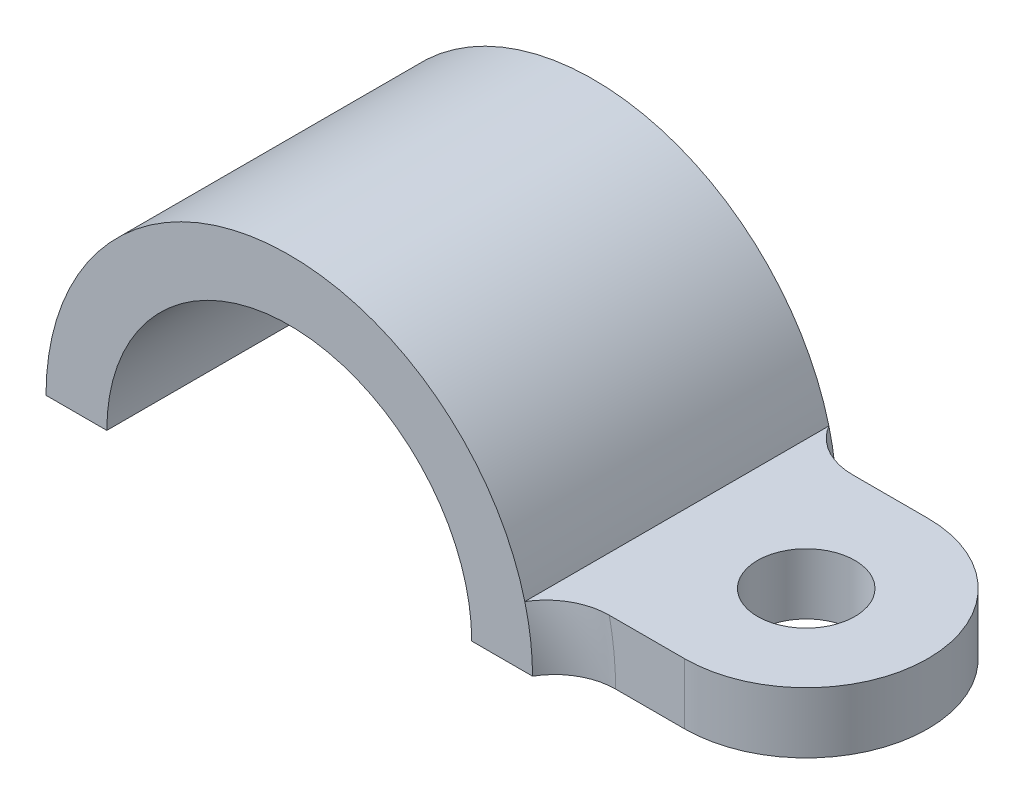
ISO-10303-21;
HEADER;
FILE_DESCRIPTION(('STEP AP214'),'2;1');
FILE_NAME('part.step','',(''),(''),'','','');
FILE_SCHEMA(('AUTOMOTIVE_DESIGN { 1 0 10303 214 1 1 1 1 }'));
ENDSEC;
DATA;
#1=APPLICATION_CONTEXT('core data for automotive mechanical design processes');
#2=APPLICATION_PROTOCOL_DEFINITION('international standard','automotive_design',2000,#1);
#3=PRODUCT_CONTEXT('',#1,'mechanical');
#4=PRODUCT('Part','Part','',(#3));
#5=PRODUCT_RELATED_PRODUCT_CATEGORY('part','',(#4));
#6=PRODUCT_DEFINITION_FORMATION('','',#4);
#7=PRODUCT_DEFINITION_CONTEXT('part definition',#1,'design');
#8=PRODUCT_DEFINITION('design','',#6,#7);
#9=PRODUCT_DEFINITION_SHAPE('','',#8);
#10=(LENGTH_UNIT() NAMED_UNIT(*) SI_UNIT(.MILLI.,.METRE.));
#11=(NAMED_UNIT(*) PLANE_ANGLE_UNIT() SI_UNIT($,.RADIAN.));
#12=(NAMED_UNIT(*) SI_UNIT($,.STERADIAN.) SOLID_ANGLE_UNIT());
#13=UNCERTAINTY_MEASURE_WITH_UNIT(LENGTH_MEASURE(1.E-05),#10,'distance_accuracy_value','');
#14=(GEOMETRIC_REPRESENTATION_CONTEXT(3) GLOBAL_UNCERTAINTY_ASSIGNED_CONTEXT((#13)) GLOBAL_UNIT_ASSIGNED_CONTEXT((#10,
#11,#12)) REPRESENTATION_CONTEXT('',''));
#15=CARTESIAN_POINT('',(0.,0.,0.));
#16=DIRECTION('',(0.,0.,1.));
#17=DIRECTION('',(1.,0.,0.));
#18=AXIS2_PLACEMENT_3D('',#15,#16,#17);
#19=CARTESIAN_POINT('',(60.,0.,0.));
#20=DIRECTION('',(0.,1.,0.));
#21=DIRECTION('',(0.,0.,1.));
#22=AXIS2_PLACEMENT_3D('',#19,#20,#21);
#23=CYLINDRICAL_SURFACE('',#22,20.);
#24=DIRECTION('',(0.,-1.,0.));
#25=VECTOR('',#24,1.);
#26=CARTESIAN_POINT('',(60.,0.,20.));
#27=LINE('',#26,#25);
#28=CARTESIAN_POINT('',(60.,0.,20.));
#29=VERTEX_POINT('',#28);
#30=CARTESIAN_POINT('',(60.,10.,20.));
#31=VERTEX_POINT('',#30);
#32=EDGE_CURVE('E153',#29,#31,#27,.F.);
#33=ORIENTED_EDGE('',*,*,#32,.F.);
#34=CARTESIAN_POINT('',(60.,0.,0.));
#35=DIRECTION('',(0.,1.,0.));
#36=DIRECTION('',(0.,0.,1.));
#37=AXIS2_PLACEMENT_3D('',#34,#35,#36);
#38=CIRCLE('',#37,20.);
#39=CARTESIAN_POINT('',(60.,0.,-20.));
#40=VERTEX_POINT('',#39);
#41=EDGE_CURVE('E170',#40,#29,#38,.F.);
#42=ORIENTED_EDGE('',*,*,#41,.F.);
#43=DIRECTION('',(0.,1.,0.));
#44=VECTOR('',#43,1.);
#45=CARTESIAN_POINT('',(60.,0.,-20.));
#46=LINE('',#45,#44);
#47=CARTESIAN_POINT('',(60.,10.,-20.));
#48=VERTEX_POINT('',#47);
#49=EDGE_CURVE('E159',#48,#40,#46,.F.);
#50=ORIENTED_EDGE('',*,*,#49,.F.);
#51=CARTESIAN_POINT('',(60.,10.,0.));
#52=DIRECTION('',(0.,-1.,0.));
#53=DIRECTION('',(1.,0.,0.));
#54=AXIS2_PLACEMENT_3D('',#51,#52,#53);
#55=CIRCLE('',#54,20.);
#56=EDGE_CURVE('E171',#31,#48,#55,.F.);
#57=ORIENTED_EDGE('',*,*,#56,.F.);
#58=EDGE_LOOP('',(#33,#42,#50,#57));
#59=FACE_BOUND('',#58,.T.);
#60=ADVANCED_FACE('F47',(#59),#23,.T.);
#61=CARTESIAN_POINT('',(0.,0.,25.));
#62=DIRECTION('',(0.,0.,-1.));
#63=DIRECTION('',(-1.,0.,0.));
#64=AXIS2_PLACEMENT_3D('',#61,#62,#63);
#65=CYLINDRICAL_SURFACE('',#64,40.);
#66=DIRECTION('',(0.,0.,-1.));
#67=VECTOR('',#66,1.);
#68=CARTESIAN_POINT('',(38.7298334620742,10.,20.));
#69=LINE('',#68,#67);
#70=CARTESIAN_POINT('',(38.7298334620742,10.,25.));
#71=VERTEX_POINT('',#70);
#72=CARTESIAN_POINT('',(38.7298334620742,10.,-25.));
#73=VERTEX_POINT('',#72);
#74=EDGE_CURVE('E300',#71,#73,#69,.T.);
#75=ORIENTED_EDGE('',*,*,#74,.T.);
#76=CARTESIAN_POINT('',(0.,0.,-25.));
#77=DIRECTION('',(0.,0.,1.));
#78=DIRECTION('',(1.,0.,0.));
#79=AXIS2_PLACEMENT_3D('',#76,#77,#78);
#80=CIRCLE('',#79,40.);
#81=CARTESIAN_POINT('',(-40.,0.,-25.));
#82=VERTEX_POINT('',#81);
#83=EDGE_CURVE('E148',#73,#82,#80,.T.);
#84=ORIENTED_EDGE('',*,*,#83,.T.);
#85=DIRECTION('',(0.,0.,-1.));
#86=VECTOR('',#85,1.);
#87=CARTESIAN_POINT('',(-40.,0.,25.));
#88=LINE('',#87,#86);
#89=CARTESIAN_POINT('',(-40.,0.,25.));
#90=VERTEX_POINT('',#89);
#91=EDGE_CURVE('E142',#90,#82,#88,.T.);
#92=ORIENTED_EDGE('',*,*,#91,.F.);
#93=CARTESIAN_POINT('',(0.,0.,25.));
#94=DIRECTION('',(0.,0.,1.));
#95=DIRECTION('',(1.,0.,0.));
#96=AXIS2_PLACEMENT_3D('',#93,#94,#95);
#97=CIRCLE('',#96,40.);
#98=EDGE_CURVE('E127',#71,#90,#97,.T.);
#99=ORIENTED_EDGE('',*,*,#98,.F.);
#100=EDGE_LOOP('',(#75,#84,#92,#99));
#101=FACE_BOUND('',#100,.T.);
#102=ADVANCED_FACE('F149',(#101),#65,.T.);
#103=CARTESIAN_POINT('',(-40.,0.,25.));
#104=DIRECTION('',(0.,1.,0.));
#105=DIRECTION('',(0.,0.,1.));
#106=AXIS2_PLACEMENT_3D('',#103,#104,#105);
#107=PLANE('',#106);
#108=DIRECTION('',(1.,0.,0.));
#109=VECTOR('',#108,1.);
#110=CARTESIAN_POINT('',(-40.,0.,-25.));
#111=LINE('',#110,#109);
#112=CARTESIAN_POINT('',(-30.,0.,-25.));
#113=VERTEX_POINT('',#112);
#114=EDGE_CURVE('E314',#82,#113,#111,.T.);
#115=ORIENTED_EDGE('',*,*,#114,.T.);
#116=DIRECTION('',(0.,0.,-1.));
#117=VECTOR('',#116,1.);
#118=CARTESIAN_POINT('',(-30.,0.,25.));
#119=LINE('',#118,#117);
#120=CARTESIAN_POINT('',(-30.,0.,25.));
#121=VERTEX_POINT('',#120);
#122=EDGE_CURVE('E141',#121,#113,#119,.T.);
#123=ORIENTED_EDGE('',*,*,#122,.F.);
#124=DIRECTION('',(1.,0.,0.));
#125=VECTOR('',#124,1.);
#126=CARTESIAN_POINT('',(-40.,0.,25.));
#127=LINE('',#126,#125);
#128=EDGE_CURVE('E126',#90,#121,#127,.T.);
#129=ORIENTED_EDGE('',*,*,#128,.F.);
#130=ORIENTED_EDGE('',*,*,#91,.T.);
#131=EDGE_LOOP('',(#115,#123,#129,#130));
#132=FACE_BOUND('',#131,.T.);
#133=ADVANCED_FACE('F140',(#132),#107,.F.);
#134=CARTESIAN_POINT('',(0.,0.,25.));
#135=DIRECTION('',(0.,0.,-1.));
#136=DIRECTION('',(-1.,0.,0.));
#137=AXIS2_PLACEMENT_3D('',#134,#135,#136);
#138=CYLINDRICAL_SURFACE('',#137,30.);
#139=CARTESIAN_POINT('',(0.,0.,-25.));
#140=DIRECTION('',(0.,0.,-1.));
#141=DIRECTION('',(1.,0.,0.));
#142=AXIS2_PLACEMENT_3D('',#139,#140,#141);
#143=CIRCLE('',#142,30.);
#144=CARTESIAN_POINT('',(30.,0.,-25.));
#145=VERTEX_POINT('',#144);
#146=EDGE_CURVE('E319',#113,#145,#143,.T.);
#147=ORIENTED_EDGE('',*,*,#146,.T.);
#148=DIRECTION('',(0.,0.,-1.));
#149=VECTOR('',#148,1.);
#150=CARTESIAN_POINT('',(30.,0.,25.));
#151=LINE('',#150,#149);
#152=CARTESIAN_POINT('',(30.,0.,25.));
#153=VERTEX_POINT('',#152);
#154=EDGE_CURVE('E160',#153,#145,#151,.T.);
#155=ORIENTED_EDGE('',*,*,#154,.F.);
#156=CARTESIAN_POINT('',(0.,0.,25.));
#157=DIRECTION('',(0.,0.,-1.));
#158=DIRECTION('',(1.,0.,0.));
#159=AXIS2_PLACEMENT_3D('',#156,#157,#158);
#160=CIRCLE('',#159,30.);
#161=EDGE_CURVE('E147',#121,#153,#160,.T.);
#162=ORIENTED_EDGE('',*,*,#161,.F.);
#163=ORIENTED_EDGE('',*,*,#122,.T.);
#164=EDGE_LOOP('',(#147,#155,#162,#163));
#165=FACE_BOUND('',#164,.T.);
#166=ADVANCED_FACE('F208',(#165),#138,.F.);
#167=CARTESIAN_POINT('',(30.,0.,25.));
#168=DIRECTION('',(0.,1.,0.));
#169=DIRECTION('',(0.,0.,1.));
#170=AXIS2_PLACEMENT_3D('',#167,#168,#169);
#171=PLANE('',#170);
#172=CARTESIAN_POINT('',(60.,0.,0.));
#173=DIRECTION('',(0.,1.,0.));
#174=DIRECTION('',(-1.,0.,0.));
#175=AXIS2_PLACEMENT_3D('',#172,#173,#174);
#176=CIRCLE('',#175,8.00000000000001);
#177=CARTESIAN_POINT('',(52.,0.,0.));
#178=VERTEX_POINT('',#177);
#179=EDGE_CURVE('E278',#178,#178,#176,.T.);
#180=ORIENTED_EDGE('',*,*,#179,.T.);
#181=EDGE_LOOP('',(#180));
#182=FACE_BOUND('',#181,.T.);
#183=DIRECTION('',(1.,0.,0.));
#184=VECTOR('',#183,1.);
#185=CARTESIAN_POINT('',(30.,0.,-25.));
#186=LINE('',#185,#184);
#187=CARTESIAN_POINT('',(40.,0.,-25.));
#188=VERTEX_POINT('',#187);
#189=EDGE_CURVE('E136',#145,#188,#186,.T.);
#190=ORIENTED_EDGE('',*,*,#189,.T.);
#191=CARTESIAN_POINT('',(48.6602540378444,0.,-30.));
#192=DIRECTION('',(0.,1.,0.));
#193=DIRECTION('',(0.,0.,1.));
#194=AXIS2_PLACEMENT_3D('',#191,#192,#193);
#195=CIRCLE('',#194,10.);
#196=CARTESIAN_POINT('',(48.6602540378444,0.,-20.));
#197=VERTEX_POINT('',#196);
#198=EDGE_CURVE('E179',#188,#197,#195,.T.);
#199=ORIENTED_EDGE('',*,*,#198,.T.);
#200=DIRECTION('',(1.,0.,0.));
#201=VECTOR('',#200,1.);
#202=CARTESIAN_POINT('',(40.,0.,-20.));
#203=LINE('',#202,#201);
#204=EDGE_CURVE('E287',#197,#40,#203,.T.);
#205=ORIENTED_EDGE('',*,*,#204,.T.);
#206=ORIENTED_EDGE('',*,*,#41,.T.);
#207=DIRECTION('',(1.,0.,0.));
#208=VECTOR('',#207,1.);
#209=CARTESIAN_POINT('',(40.,0.,20.));
#210=LINE('',#209,#208);
#211=CARTESIAN_POINT('',(48.6602540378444,0.,20.));
#212=VERTEX_POINT('',#211);
#213=EDGE_CURVE('E290',#212,#29,#210,.T.);
#214=ORIENTED_EDGE('',*,*,#213,.F.);
#215=CARTESIAN_POINT('',(48.6602540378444,0.,30.));
#216=DIRECTION('',(0.,1.,0.));
#217=DIRECTION('',(0.,0.,1.));
#218=AXIS2_PLACEMENT_3D('',#215,#216,#217);
#219=CIRCLE('',#218,10.);
#220=CARTESIAN_POINT('',(40.,0.,25.));
#221=VERTEX_POINT('',#220);
#222=EDGE_CURVE('E61',#212,#221,#219,.T.);
#223=ORIENTED_EDGE('',*,*,#222,.T.);
#224=DIRECTION('',(1.,0.,0.));
#225=VECTOR('',#224,1.);
#226=CARTESIAN_POINT('',(30.,0.,25.));
#227=LINE('',#226,#225);
#228=EDGE_CURVE('E308',#153,#221,#227,.T.);
#229=ORIENTED_EDGE('',*,*,#228,.F.);
#230=ORIENTED_EDGE('',*,*,#154,.T.);
#231=EDGE_LOOP('',(#190,#199,#205,#206,#214,#223,#229,#230));
#232=FACE_BOUND('',#231,.T.);
#233=ADVANCED_FACE('F214',(#182,#232),#171,.F.);
#234=CARTESIAN_POINT('',(0.,0.,25.));
#235=DIRECTION('',(0.,0.,1.));
#236=DIRECTION('',(1.,0.,0.));
#237=AXIS2_PLACEMENT_3D('',#234,#235,#236);
#238=PLANE('',#237);
#239=EDGE_CURVE('E135',#221,#71,#97,.T.);
#240=ORIENTED_EDGE('',*,*,#239,.T.);
#241=ORIENTED_EDGE('',*,*,#98,.T.);
#242=ORIENTED_EDGE('',*,*,#128,.T.);
#243=ORIENTED_EDGE('',*,*,#161,.T.);
#244=ORIENTED_EDGE('',*,*,#228,.T.);
#245=EDGE_LOOP('',(#240,#241,#242,#243,#244));
#246=FACE_BOUND('',#245,.T.);
#247=ADVANCED_FACE('F129',(#246),#238,.T.);
#248=CARTESIAN_POINT('',(0.,0.,-25.));
#249=DIRECTION('',(0.,0.,1.));
#250=DIRECTION('',(1.,0.,0.));
#251=AXIS2_PLACEMENT_3D('',#248,#249,#250);
#252=PLANE('',#251);
#253=EDGE_CURVE('E311',#188,#73,#80,.T.);
#254=ORIENTED_EDGE('',*,*,#253,.F.);
#255=ORIENTED_EDGE('',*,*,#189,.F.);
#256=ORIENTED_EDGE('',*,*,#146,.F.);
#257=ORIENTED_EDGE('',*,*,#114,.F.);
#258=ORIENTED_EDGE('',*,*,#83,.F.);
#259=EDGE_LOOP('',(#254,#255,#256,#257,#258));
#260=FACE_BOUND('',#259,.T.);
#261=ADVANCED_FACE('F218',(#260),#252,.F.);
#262=CARTESIAN_POINT('',(80.,10.,20.));
#263=DIRECTION('',(0.,-1.,0.));
#264=DIRECTION('',(1.,0.,0.));
#265=AXIS2_PLACEMENT_3D('',#262,#263,#264);
#266=PLANE('',#265);
#267=CARTESIAN_POINT('',(60.,10.,0.));
#268=DIRECTION('',(0.,1.,0.));
#269=DIRECTION('',(-1.,0.,0.));
#270=AXIS2_PLACEMENT_3D('',#267,#268,#269);
#271=CIRCLE('',#270,8.00000000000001);
#272=CARTESIAN_POINT('',(52.,10.,0.));
#273=VERTEX_POINT('',#272);
#274=EDGE_CURVE('E283',#273,#273,#271,.T.);
#275=ORIENTED_EDGE('',*,*,#274,.F.);
#276=EDGE_LOOP('',(#275));
#277=FACE_BOUND('',#276,.T.);
#278=DIRECTION('',(-1.,0.,0.));
#279=VECTOR('',#278,1.);
#280=CARTESIAN_POINT('',(80.,10.,20.));
#281=LINE('',#280,#279);
#282=CARTESIAN_POINT('',(47.6216371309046,10.,20.));
#283=VERTEX_POINT('',#282);
#284=EDGE_CURVE('E291',#31,#283,#281,.T.);
#285=ORIENTED_EDGE('',*,*,#284,.F.);
#286=ORIENTED_EDGE('',*,*,#56,.T.);
#287=DIRECTION('',(-1.,0.,0.));
#288=VECTOR('',#287,1.);
#289=CARTESIAN_POINT('',(80.,10.,-20.));
#290=LINE('',#289,#288);
#291=CARTESIAN_POINT('',(47.6216371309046,10.,-20.));
#292=VERTEX_POINT('',#291);
#293=EDGE_CURVE('E295',#48,#292,#290,.T.);
#294=ORIENTED_EDGE('',*,*,#293,.T.);
#295=CARTESIAN_POINT('',(47.6216371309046,10.,-20.));
#296=CARTESIAN_POINT('',(47.3275635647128,10.,-19.9999725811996));
#297=CARTESIAN_POINT('',(47.0334977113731,10.,-20.01242289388));
#298=CARTESIAN_POINT('',(46.4474700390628,10.,-20.0620205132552));
#299=CARTESIAN_POINT('',(46.155508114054,10.,-20.0991665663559));
#300=CARTESIAN_POINT('',(45.5759581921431,10.,-20.1978612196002));
#301=CARTESIAN_POINT('',(45.2883671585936,10.,-20.2593919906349));
#302=CARTESIAN_POINT('',(44.7193773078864,10.,-20.4064113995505));
#303=CARTESIAN_POINT('',(44.4379784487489,10.,-20.4918998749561));
#304=CARTESIAN_POINT('',(43.883221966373,10.,-20.686310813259));
#305=CARTESIAN_POINT('',(43.6098688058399,10.,-20.7952460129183));
#306=CARTESIAN_POINT('',(43.0732082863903,10.,-21.0358552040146));
#307=CARTESIAN_POINT('',(42.809905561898,10.,-21.1675395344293));
#308=CARTESIAN_POINT('',(42.295507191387,10.,-21.4526919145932));
#309=CARTESIAN_POINT('',(42.0444066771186,10.,-21.6061511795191));
#310=CARTESIAN_POINT('',(41.5562899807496,10.,-21.9338095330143));
#311=CARTESIAN_POINT('',(41.319267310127,10.,-22.1079989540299));
#312=CARTESIAN_POINT('',(40.8558274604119,10.,-22.4801785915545));
#313=CARTESIAN_POINT('',(40.6297696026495,10.,-22.6786166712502));
#314=CARTESIAN_POINT('',(40.1960204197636,10.,-23.0946419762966));
#315=CARTESIAN_POINT('',(39.9883288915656,10.,-23.3122289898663));
#316=CARTESIAN_POINT('',(39.5925441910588,10.,-23.7656411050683));
#317=CARTESIAN_POINT('',(39.4045075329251,10.,-24.0015155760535));
#318=CARTESIAN_POINT('',(39.0503222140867,10.,-24.4892347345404));
#319=CARTESIAN_POINT('',(38.8841782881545,10.,-24.7410828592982));
#320=CARTESIAN_POINT('',(38.7298334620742,10.,-25.));
#321=B_SPLINE_CURVE_WITH_KNOTS('',3,(#295,#296,#297,#298,#299,#300,#301,#302,#303,#304,#305,
#306,#307,#308,#309,#310,#311,#312,#313,#314,#315,#316,#317,#318,#319,#320),.UNSPECIFIED.,.F.,
.F.,(4,2,2,2,2,2,2,2,2,2,2,2,4),(0.,0.881946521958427,1.76384827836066,2.64510641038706,
3.52635856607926,4.40809065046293,5.29022452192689,6.17200351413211,7.05337288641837,
7.95460227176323,8.85582169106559,9.75956497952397,10.6635034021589),.UNSPECIFIED.);
#322=EDGE_CURVE('E182',#292,#73,#321,.T.);
#323=ORIENTED_EDGE('',*,*,#322,.T.);
#324=ORIENTED_EDGE('',*,*,#74,.F.);
#325=CARTESIAN_POINT('',(38.7298334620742,10.,25.));
#326=CARTESIAN_POINT('',(38.8768130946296,10.,24.7534474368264));
#327=CARTESIAN_POINT('',(39.0344881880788,10.,24.5132998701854));
#328=CARTESIAN_POINT('',(39.3697661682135,10.,24.0474146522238));
#329=CARTESIAN_POINT('',(39.5473649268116,10.,23.821674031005));
#330=CARTESIAN_POINT('',(39.9206019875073,10.,23.3866670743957));
#331=CARTESIAN_POINT('',(40.1161920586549,10.,23.1773593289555));
#332=CARTESIAN_POINT('',(40.5242729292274,10.,22.7759168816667));
#333=CARTESIAN_POINT('',(40.7367642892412,10.,22.5837827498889));
#334=CARTESIAN_POINT('',(41.1769775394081,10.,22.2179742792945));
#335=CARTESIAN_POINT('',(41.4046951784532,10.,22.0442948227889));
#336=CARTESIAN_POINT('',(41.8738510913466,10.,21.7163510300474));
#337=CARTESIAN_POINT('',(42.1152953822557,10.,21.5620953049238));
#338=CARTESIAN_POINT('',(42.6102602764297,10.,21.2739519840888));
#339=CARTESIAN_POINT('',(42.8637887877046,10.,21.1400779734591));
#340=CARTESIAN_POINT('',(43.380892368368,10.,20.8937049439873));
#341=CARTESIAN_POINT('',(43.6444633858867,10.,20.7811974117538));
#342=CARTESIAN_POINT('',(44.2074399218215,10.,20.5677750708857));
#343=CARTESIAN_POINT('',(44.507748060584,10.,20.4692329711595));
#344=CARTESIAN_POINT('',(45.1160624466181,10.,20.2996699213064));
#345=CARTESIAN_POINT('',(45.4240695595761,10.,20.2286520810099));
#346=CARTESIAN_POINT('',(46.0457021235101,10.,20.1146504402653));
#347=CARTESIAN_POINT('',(46.3593351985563,10.,20.0717081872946));
#348=CARTESIAN_POINT('',(46.9891881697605,10.,20.0143649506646));
#349=CARTESIAN_POINT('',(47.3054079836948,10.,19.9999630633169));
#350=CARTESIAN_POINT('',(47.6216371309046,10.,20.));
#351=B_SPLINE_CURVE_WITH_KNOTS('',3,(#325,#326,#327,#328,#329,#330,#331,#332,#333,#334,#335,
#336,#337,#338,#339,#340,#341,#342,#343,#344,#345,#346,#347,#348,#349,#350),.UNSPECIFIED.,.F.,
.F.,(4,2,2,2,2,2,2,2,2,2,2,2,4),(0.,0.860812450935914,1.72144687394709,2.57983785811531,
3.43825732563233,4.29643811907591,5.15499803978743,6.01412773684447,6.87291439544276,
7.81978670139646,8.76676595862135,9.71514344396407,10.663490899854),.UNSPECIFIED.);
#352=EDGE_CURVE('E11',#71,#283,#351,.T.);
#353=ORIENTED_EDGE('',*,*,#352,.T.);
#354=EDGE_LOOP('',(#285,#286,#294,#323,#324,#353));
#355=FACE_BOUND('',#354,.T.);
#356=ADVANCED_FACE('F188',(#277,#355),#266,.F.);
#357=CARTESIAN_POINT('',(0.,0.,20.));
#358=DIRECTION('',(0.,0.,1.));
#359=DIRECTION('',(1.,0.,0.));
#360=AXIS2_PLACEMENT_3D('',#357,#358,#359);
#361=PLANE('',#360);
#362=ORIENTED_EDGE('',*,*,#284,.T.);
#363=CARTESIAN_POINT('',(0.,0.,20.));
#364=DIRECTION('',(0.,0.,1.));
#365=DIRECTION('',(1.,0.,0.));
#366=AXIS2_PLACEMENT_3D('',#363,#364,#365);
#367=CIRCLE('',#366,48.6602540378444);
#368=EDGE_CURVE('E180',#283,#212,#367,.F.);
#369=ORIENTED_EDGE('',*,*,#368,.T.);
#370=ORIENTED_EDGE('',*,*,#213,.T.);
#371=ORIENTED_EDGE('',*,*,#32,.T.);
#372=EDGE_LOOP('',(#362,#369,#370,#371));
#373=FACE_BOUND('',#372,.T.);
#374=ADVANCED_FACE('F232',(#373),#361,.T.);
#375=CARTESIAN_POINT('',(0.,0.,-20.));
#376=DIRECTION('',(0.,0.,1.));
#377=DIRECTION('',(1.,0.,0.));
#378=AXIS2_PLACEMENT_3D('',#375,#376,#377);
#379=PLANE('',#378);
#380=ORIENTED_EDGE('',*,*,#204,.F.);
#381=CARTESIAN_POINT('',(0.,0.,-20.));
#382=DIRECTION('',(0.,0.,1.));
#383=DIRECTION('',(1.,0.,0.));
#384=AXIS2_PLACEMENT_3D('',#381,#382,#383);
#385=CIRCLE('',#384,48.6602540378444);
#386=EDGE_CURVE('E172',#197,#292,#385,.T.);
#387=ORIENTED_EDGE('',*,*,#386,.T.);
#388=ORIENTED_EDGE('',*,*,#293,.F.);
#389=ORIENTED_EDGE('',*,*,#49,.T.);
#390=EDGE_LOOP('',(#380,#387,#388,#389));
#391=FACE_BOUND('',#390,.T.);
#392=ADVANCED_FACE('F198',(#391),#379,.F.);
#393=CARTESIAN_POINT('',(0.,0.,-30.));
#394=DIRECTION('',(0.,0.,1.));
#395=DIRECTION('',(1.,0.,0.));
#396=AXIS2_PLACEMENT_3D('',#393,#394,#395);
#397=TOROIDAL_SURFACE('',#396,48.6602540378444,10.);
#398=ORIENTED_EDGE('',*,*,#322,.F.);
#399=ORIENTED_EDGE('',*,*,#386,.F.);
#400=ORIENTED_EDGE('',*,*,#198,.F.);
#401=ORIENTED_EDGE('',*,*,#253,.T.);
#402=EDGE_LOOP('',(#398,#399,#400,#401));
#403=FACE_BOUND('',#402,.T.);
#404=ADVANCED_FACE('F191',(#403),#397,.F.);
#405=CARTESIAN_POINT('',(0.,0.,30.));
#406=DIRECTION('',(0.,0.,1.));
#407=DIRECTION('',(1.,0.,0.));
#408=AXIS2_PLACEMENT_3D('',#405,#406,#407);
#409=TOROIDAL_SURFACE('',#408,48.6602540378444,10.);
#410=ORIENTED_EDGE('',*,*,#352,.F.);
#411=ORIENTED_EDGE('',*,*,#239,.F.);
#412=ORIENTED_EDGE('',*,*,#222,.F.);
#413=ORIENTED_EDGE('',*,*,#368,.F.);
#414=EDGE_LOOP('',(#410,#411,#412,#413));
#415=FACE_BOUND('',#414,.T.);
#416=ADVANCED_FACE('F51',(#415),#409,.F.);
#417=CARTESIAN_POINT('',(60.,0.,0.));
#418=DIRECTION('',(0.,1.,0.));
#419=DIRECTION('',(-1.,0.,0.));
#420=AXIS2_PLACEMENT_3D('',#417,#418,#419);
#421=CYLINDRICAL_SURFACE('',#420,8.00000000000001);
#422=ORIENTED_EDGE('',*,*,#179,.F.);
#423=EDGE_LOOP('',(#422));
#424=FACE_BOUND('',#423,.T.);
#425=ORIENTED_EDGE('',*,*,#274,.T.);
#426=EDGE_LOOP('',(#425));
#427=FACE_BOUND('',#426,.T.);
#428=ADVANCED_FACE('F260',(#424,#427),#421,.F.);
#429=CLOSED_SHELL('',(#60,#102,#133,#166,#233,#247,#261,#356,#374,#392,#404,#416,#428));
#430=MANIFOLD_SOLID_BREP('B2',#429);
#431=ADVANCED_BREP_SHAPE_REPRESENTATION('',(#18,#430),#14);
#432=SHAPE_DEFINITION_REPRESENTATION(#9,#431);
ENDSEC;
END-ISO-10303-21;
